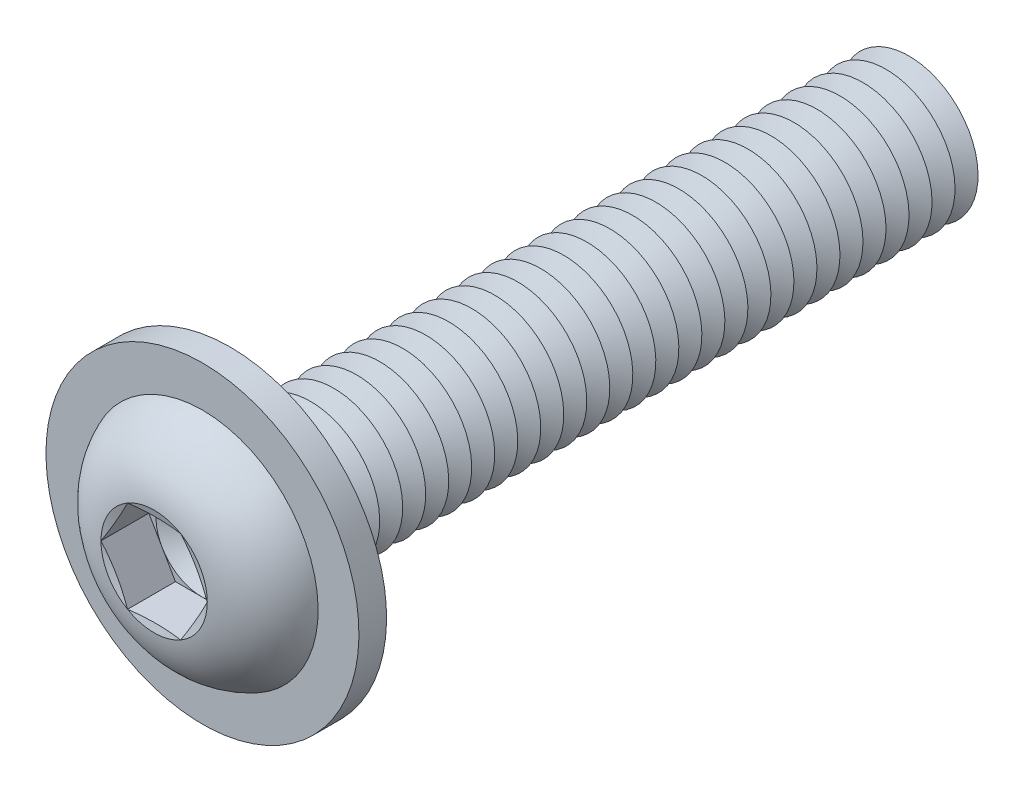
from build123d import *

# Parameters (mm, degrees)
FILLET1_R           = 0.5
LPATTERN1_COUNT     = 30
LPATTERN1_PITCH     = 1
CUT_EXTRUDE1_DEPTH  = 2.08
SKETCH5_R           = 6.8
SKETCH5_R_2         = 3.5
BOSS_EXTRUDE1_DEPTH = 1.2


with BuildPart() as part:
    # Sketch1 → Revolve1 (revolve)
    with BuildSketch(Plane(origin=(0, 0, 0), x_dir=(0, 0, -1), z_dir=(1, 0, 0))):
        with BuildLine():
            Line((0, 3), (0, 5.25))
            ThreePointArc((0, 5.25), (-2.210041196, 4.408189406), (-3.3, 2.3094))
            Line((-3.3, 2.3094), (-2.990599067, 1.1547))
            Line((-2.990599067, 1.1547), (-3.3, 1.1547))
            Line((-3.3, 1.1547), (-3.3, 0))
            Line((-3.3, 0), (30, 0))
            Line((30, 0), (30, 3))
            Line((30, 3), (0, 3))
        make_face()
    revolve(axis=Axis((0, 0, -30), (0, 0, 1)))

    # Fillet1
    fillet1_edges = [part.edges().sort_by_distance(p)[0] for p in [
        (0, -3, 0),
    ]]
    fillet(fillet1_edges, radius=FILLET1_R)

    # Sketch2 → Cut-Revolve1 (revolve, cut)
    with BuildSketch(Plane(origin=(0, 0, 0), x_dir=(0, 0, -1), z_dir=(1, 0, 0))):
        Polygon((29.5, 3), (30.5, 3), (30, 2.133974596), align=None)
    cut_revolve1 = revolve(axis=Axis((0, 0, -30), (0, 0, -1)), mode=Mode.SUBTRACT)

    # LPattern1: Cut-Revolve1 ×30
    with Locations(*[(0, 0, i * LPATTERN1_PITCH) for i in range(1, LPATTERN1_COUNT)]):
        add(cut_revolve1, mode=Mode.SUBTRACT)

    # Sketch3 → Cut-Extrude1 (cut)
    with BuildSketch(Plane.XY.offset(3.3)):
        Polygon((1.1547, 1.999999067), (-1.1547, 1.999999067), (-2.3094, 0), (-1.1547, -1.999999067), (1.1547, -1.999999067), (2.3094, 0), align=None)
    extrude(amount=-CUT_EXTRUDE1_DEPTH, mode=Mode.SUBTRACT)

    # Cut-Extrude2 cone 1 section (on through the dimple's axis) → Cut-Extrude2 (revolve, cut)
    with BuildSketch(Plane(origin=(0, 0, 1.22), x_dir=(0, -1, 0), z_dir=(1, 0, 0))):
        Polygon((0, 0), (1.999999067, 0), (0, 1.1547), align=None)
    revolve(axis=Axis((0, 0, 1.22), (0, 0, -1)), mode=Mode.SUBTRACT)

    # Sketch5 → Boss-Extrude1 (add)
    with BuildSketch(Plane(origin=(0, 0, 0), x_dir=(-1, 0, 0), z_dir=(0, 0, -1))):
        with Locations(Location((0, 0, 0), (0, 0, 90))):
            Circle(SKETCH5_R)
        Circle(SKETCH5_R_2, mode=Mode.SUBTRACT)
    extrude(amount=-BOSS_EXTRUDE1_DEPTH)


solid = part.part
